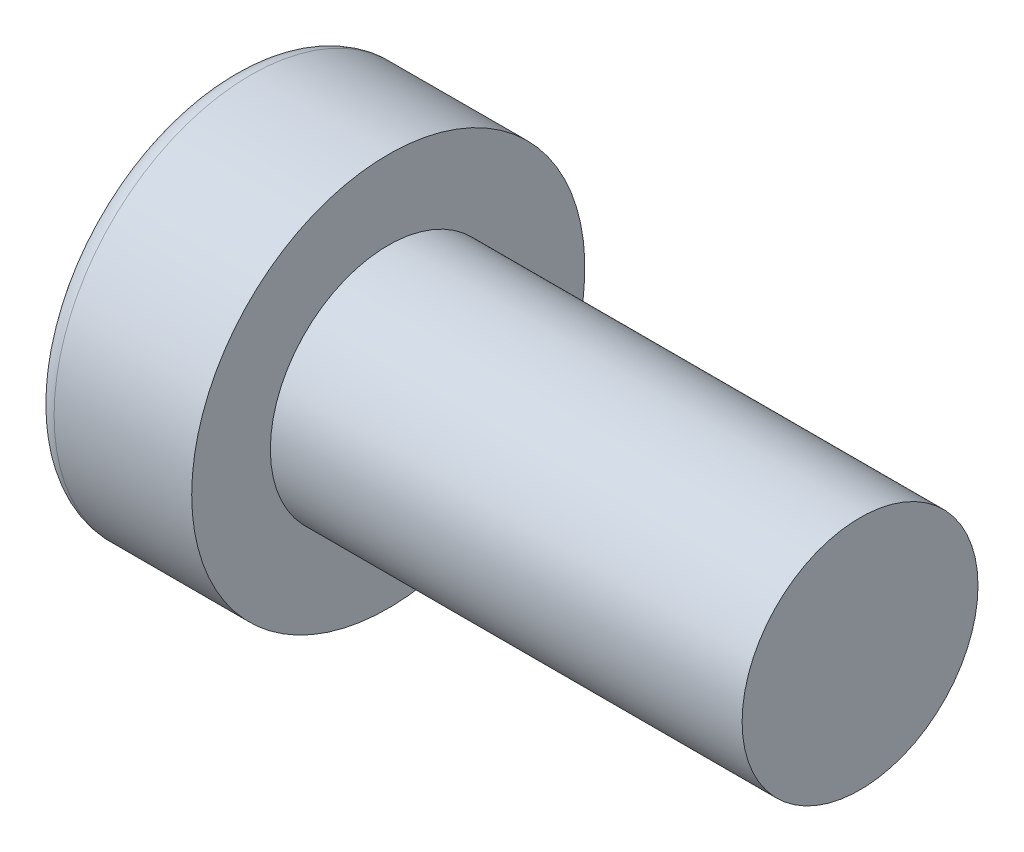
from build123d import *

# Parameters (mm, degrees)
VERRUNDUNG1_R                   = 0.5
SCHNITT_LINEAR_AUSTRAGEN1_DEPTH = 3


with BuildPart() as part:
    # Skizze1 → Rotation1 (revolve)
    with BuildSketch(Plane.XY, mode=Mode.PRIVATE) as rotation1_sk:
        Polygon((-16, 0), (-16, 5), (-12, 5), (-12, 3), (0, 3), (0, 0), align=None)
    revolve(rotation1_sk.sketch.rotate(Axis((-65.011808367, 0, 0), (1, 0, 0)), 90), axis=Axis((-65.011808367, 0, 0), (1, 0, 0)))

    # Verrundung1
    verrundung1_edges = [part.edges().sort_by_distance(p)[0] for p in [
        (-16, 0, -5),
    ]]
    fillet(verrundung1_edges, radius=VERRUNDUNG1_R)

    # Skizze2 → Schnitt-Linear austragen1 (cut)
    with BuildSketch(Plane.ZY.offset(16)):
        Polygon((2, 1.154700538), (0, 2.309401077), (-2, 1.154700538), (-2, -1.154700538), (0, -2.309401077), (2, -1.154700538), align=None)
    extrude(amount=-SCHNITT_LINEAR_AUSTRAGEN1_DEPTH, mode=Mode.SUBTRACT)


solid = part.part
